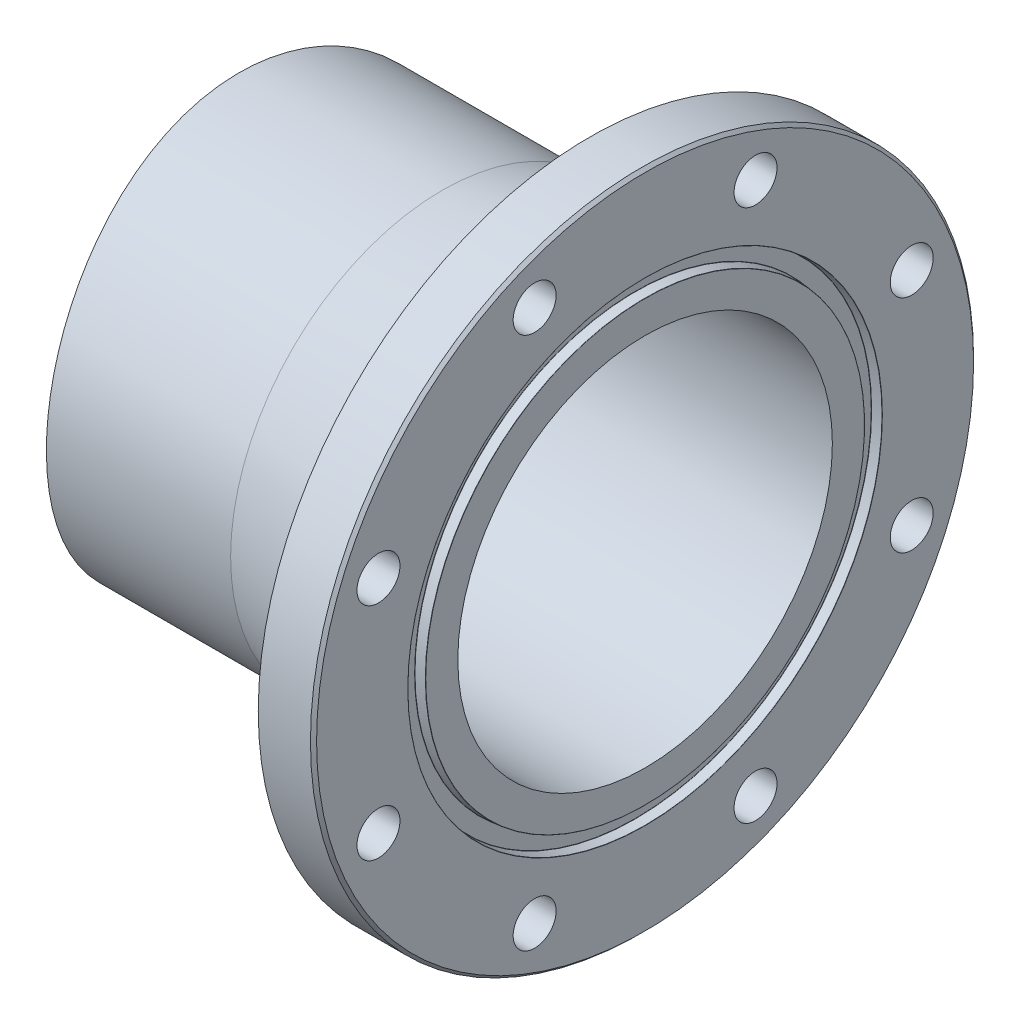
ISO-10303-21;
HEADER;
FILE_DESCRIPTION(('STEP AP214'),'2;1');
FILE_NAME('part.step','',(''),(''),'','','');
FILE_SCHEMA(('AUTOMOTIVE_DESIGN { 1 0 10303 214 1 1 1 1 }'));
ENDSEC;
DATA;
#1=APPLICATION_CONTEXT('core data for automotive mechanical design processes');
#2=APPLICATION_PROTOCOL_DEFINITION('international standard','automotive_design',2000,#1);
#3=PRODUCT_CONTEXT('',#1,'mechanical');
#4=PRODUCT('Part','Part','',(#3));
#5=PRODUCT_RELATED_PRODUCT_CATEGORY('part','',(#4));
#6=PRODUCT_DEFINITION_FORMATION('','',#4);
#7=PRODUCT_DEFINITION_CONTEXT('part definition',#1,'design');
#8=PRODUCT_DEFINITION('design','',#6,#7);
#9=PRODUCT_DEFINITION_SHAPE('','',#8);
#10=(LENGTH_UNIT() NAMED_UNIT(*) SI_UNIT(.MILLI.,.METRE.));
#11=(NAMED_UNIT(*) PLANE_ANGLE_UNIT() SI_UNIT($,.RADIAN.));
#12=(NAMED_UNIT(*) SI_UNIT($,.STERADIAN.) SOLID_ANGLE_UNIT());
#13=UNCERTAINTY_MEASURE_WITH_UNIT(LENGTH_MEASURE(1.E-05),#10,'distance_accuracy_value','');
#14=(GEOMETRIC_REPRESENTATION_CONTEXT(3) GLOBAL_UNCERTAINTY_ASSIGNED_CONTEXT((#13)) GLOBAL_UNIT_ASSIGNED_CONTEXT((#10,
#11,#12)) REPRESENTATION_CONTEXT('',''));
#15=CARTESIAN_POINT('',(0.,0.,0.));
#16=DIRECTION('',(0.,0.,1.));
#17=DIRECTION('',(1.,0.,0.));
#18=AXIS2_PLACEMENT_3D('',#15,#16,#17);
#19=CARTESIAN_POINT('',(0.,0.,0.));
#20=DIRECTION('',(-1.,0.,0.));
#21=DIRECTION('',(0.,0.,1.));
#22=AXIS2_PLACEMENT_3D('',#19,#20,#21);
#23=CYLINDRICAL_SURFACE('',#22,96.8375);
#24=CARTESIAN_POINT('',(19.05,0.,96.8375));
#25=CARTESIAN_POINT('',(19.0500011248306,1.35111206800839,96.837502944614));
#26=CARTESIAN_POINT('',(19.0455060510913,2.70215124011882,96.809221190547));
#27=CARTESIAN_POINT('',(19.0275604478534,5.40179370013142,96.6961578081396));
#28=CARTESIAN_POINT('',(19.014110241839,6.75039707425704,96.6113782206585));
#29=CARTESIAN_POINT('',(18.9783443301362,9.44303387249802,96.3854570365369));
#30=CARTESIAN_POINT('',(18.956026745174,10.7870662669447,96.2443034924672));
#31=CARTESIAN_POINT('',(18.9026831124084,13.4679056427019,95.9059032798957));
#32=CARTESIAN_POINT('',(18.8716568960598,14.80471248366,95.7086555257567));
#33=CARTESIAN_POINT('',(18.8010857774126,17.469762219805,95.258262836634));
#34=CARTESIAN_POINT('',(18.7615340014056,18.7979973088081,95.0050727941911));
#35=CARTESIAN_POINT('',(18.6742009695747,21.442561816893,94.4433450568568));
#36=CARTESIAN_POINT('',(18.626418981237,22.7588901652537,94.1348024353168));
#37=CARTESIAN_POINT('',(18.5229709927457,25.3769990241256,93.4630168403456));
#38=CARTESIAN_POINT('',(18.4673061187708,26.6787815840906,93.0997816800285));
#39=CARTESIAN_POINT('',(18.3484718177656,29.2658146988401,92.3192242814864));
#40=CARTESIAN_POINT('',(18.2853016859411,30.5510636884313,91.9018969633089));
#41=CARTESIAN_POINT('',(18.1519614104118,33.1015322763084,91.0143479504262));
#42=CARTESIAN_POINT('',(18.0817974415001,34.3667684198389,90.5441728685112));
#43=CARTESIAN_POINT('',(17.9349055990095,36.8762746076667,89.5514529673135));
#44=CARTESIAN_POINT('',(17.8581771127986,38.1205426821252,89.0289032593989));
#45=CARTESIAN_POINT('',(17.6987022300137,40.5857337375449,87.9324701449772));
#46=CARTESIAN_POINT('',(17.6159563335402,41.8066586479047,87.3585910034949));
#47=CARTESIAN_POINT('',(17.4450074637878,44.2232787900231,86.160443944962));
#48=CARTESIAN_POINT('',(17.3568039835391,45.418971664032,85.5361713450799));
#49=CARTESIAN_POINT('',(17.1755794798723,47.7826821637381,84.2385539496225));
#50=CARTESIAN_POINT('',(17.0825596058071,48.9507062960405,83.5652208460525));
#51=CARTESIAN_POINT('',(16.8923183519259,51.2574817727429,82.1704864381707));
#52=CARTESIAN_POINT('',(16.7950965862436,52.3962304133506,81.4490807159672));
#53=CARTESIAN_POINT('',(16.5971374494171,54.6423302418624,79.9595688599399));
#54=CARTESIAN_POINT('',(16.496400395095,55.7496842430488,79.1914669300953));
#55=CARTESIAN_POINT('',(16.2920980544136,57.9312434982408,77.6098477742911));
#56=CARTESIAN_POINT('',(16.1885325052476,59.0054456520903,76.7963263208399));
#57=CARTESIAN_POINT('',(15.8730455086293,62.191849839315,74.2767947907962));
#58=CARTESIAN_POINT('',(15.6578467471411,64.2508609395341,72.5030792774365));
#59=CARTESIAN_POINT('',(15.2249008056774,68.2121891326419,68.7893337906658));
#60=CARTESIAN_POINT('',(15.0071536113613,70.1145053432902,66.8493028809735));
#61=CARTESIAN_POINT('',(14.5751738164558,73.7498128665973,62.8158951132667));
#62=CARTESIAN_POINT('',(14.3609414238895,75.4827941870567,60.7225092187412));
#63=CARTESIAN_POINT('',(13.9420508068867,78.7671406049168,56.3969308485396));
#64=CARTESIAN_POINT('',(13.7373925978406,80.3185054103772,54.1647381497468));
#65=CARTESIAN_POINT('',(13.3423533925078,83.2368107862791,49.5640639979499));
#66=CARTESIAN_POINT('',(13.1520583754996,84.6026746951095,47.1948919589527));
#67=CARTESIAN_POINT('',(12.7925180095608,87.129764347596,42.3482540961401));
#68=CARTESIAN_POINT('',(12.6232727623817,88.2909891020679,39.8707877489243));
#69=CARTESIAN_POINT('',(12.3107750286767,90.4001286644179,34.8251964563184));
#70=CARTESIAN_POINT('',(12.1675213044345,91.3480536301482,32.2570758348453));
#71=CARTESIAN_POINT('',(11.9112119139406,93.0234761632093,27.0484435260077));
#72=CARTESIAN_POINT('',(11.7981559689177,93.7509757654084,24.4079325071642));
#73=CARTESIAN_POINT('',(11.6063993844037,94.9747939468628,19.0959753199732));
#74=CARTESIAN_POINT('',(11.5274188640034,95.4729982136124,16.4249736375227));
#75=CARTESIAN_POINT('',(11.4047631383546,96.2433148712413,11.0497587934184));
#76=CARTESIAN_POINT('',(11.3610877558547,96.5154283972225,8.3455457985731));
#77=CARTESIAN_POINT('',(11.3103310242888,96.8314395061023,2.92362883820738));
#78=CARTESIAN_POINT('',(11.3032475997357,96.8753500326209,0.20592564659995));
#79=CARTESIAN_POINT('',(11.3258786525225,96.7346461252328,-5.22339639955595));
#80=CARTESIAN_POINT('',(11.3555929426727,96.5500328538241,-7.93501528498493));
#81=CARTESIAN_POINT('',(11.4504948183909,95.9565173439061,-13.3072632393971));
#82=CARTESIAN_POINT('',(11.5153481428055,95.5497282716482,-15.9681320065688));
#83=CARTESIAN_POINT('',(11.6784323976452,94.5163922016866,-21.2457830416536));
#84=CARTESIAN_POINT('',(11.776663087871,93.8898467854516,-23.8625656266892));
#85=CARTESIAN_POINT('',(12.0036862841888,92.4216764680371,-29.0337662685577));
#86=CARTESIAN_POINT('',(12.1324794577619,91.5800468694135,-31.5881829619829));
#87=CARTESIAN_POINT('',(12.416958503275,89.6879115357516,-36.6168966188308));
#88=CARTESIAN_POINT('',(12.5726445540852,88.6374044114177,-39.0911930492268));
#89=CARTESIAN_POINT('',(12.9072436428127,86.3300594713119,-43.9533272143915));
#90=CARTESIAN_POINT('',(13.0862553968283,85.0723383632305,-46.3407389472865));
#91=CARTESIAN_POINT('',(13.461916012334,82.3628254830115,-51.0012947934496));
#92=CARTESIAN_POINT('',(13.658564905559,80.9110333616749,-53.2744387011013));
#93=CARTESIAN_POINT('',(14.0640039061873,77.8234529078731,-57.6911798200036));
#94=CARTESIAN_POINT('',(14.2727947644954,76.1876531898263,-59.8347690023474));
#95=CARTESIAN_POINT('',(14.6966993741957,72.7434025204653,-63.9777758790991));
#96=CARTESIAN_POINT('',(14.911813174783,70.9349502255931,-65.9771924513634));
#97=CARTESIAN_POINT('',(15.3448353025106,67.1364466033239,-69.8399490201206));
#98=CARTESIAN_POINT('',(15.5627478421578,65.1445811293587,-71.7015050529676));
#99=CARTESIAN_POINT('',(15.9928073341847,61.0106585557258,-75.2503956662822));
#100=CARTESIAN_POINT('',(16.2049542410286,58.8686002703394,-76.9377288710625));
#101=CARTESIAN_POINT('',(16.6175080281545,54.4490753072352,-80.1263027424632));
#102=CARTESIAN_POINT('',(16.8179147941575,52.1716073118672,-81.6275415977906));
#103=CARTESIAN_POINT('',(17.2013353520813,47.4970834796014,-84.43316326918));
#104=CARTESIAN_POINT('',(17.3843491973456,45.100028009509,-85.7375466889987));
#105=CARTESIAN_POINT('',(17.7279371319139,40.2012884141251,-88.1408333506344));
#106=CARTESIAN_POINT('',(17.8884947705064,37.6995293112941,-89.2395861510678));
#107=CARTESIAN_POINT('',(18.1824505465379,32.6107108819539,-91.2222539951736));
#108=CARTESIAN_POINT('',(18.3158486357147,30.0236514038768,-92.1061686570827));
#109=CARTESIAN_POINT('',(18.5516714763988,24.7829171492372,-93.6523995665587));
#110=CARTESIAN_POINT('',(18.6540981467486,22.1292465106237,-94.3147295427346));
#111=CARTESIAN_POINT('',(18.8250539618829,16.774352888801,-95.4127475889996));
#112=CARTESIAN_POINT('',(18.893583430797,14.0731303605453,-95.848437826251));
#113=CARTESIAN_POINT('',(18.9942357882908,8.67192267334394,-96.4863459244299));
#114=CARTESIAN_POINT('',(19.026740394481,5.9722335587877,-96.6910121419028));
#115=CARTESIAN_POINT('',(19.0557333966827,0.565013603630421,-96.8736282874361));
#116=CARTESIAN_POINT('',(19.0522220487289,-2.14251718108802,-96.8515798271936));
#117=CARTESIAN_POINT('',(19.0092830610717,-7.54584999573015,-96.5809437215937));
#118=CARTESIAN_POINT('',(18.9698566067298,-10.2416524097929,-96.3323635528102));
#119=CARTESIAN_POINT('',(18.8562001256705,-15.6022679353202,-95.6105899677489));
#120=CARTESIAN_POINT('',(18.7819701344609,-18.2670810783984,-95.1373967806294));
#121=CARTESIAN_POINT('',(18.6012904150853,-23.5322486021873,-93.9732107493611));
#122=CARTESIAN_POINT('',(18.4950191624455,-26.1328758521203,-93.2834235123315));
#123=CARTESIAN_POINT('',(18.253063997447,-31.2664825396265,-91.6904105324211));
#124=CARTESIAN_POINT('',(18.1173802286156,-33.7994623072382,-90.7871858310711));
#125=CARTESIAN_POINT('',(17.820338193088,-38.7803691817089,-88.7738725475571));
#126=CARTESIAN_POINT('',(17.6589789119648,-41.2282929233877,-87.6637757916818));
#127=CARTESIAN_POINT('',(17.3150238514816,-46.0222646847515,-85.2447139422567));
#128=CARTESIAN_POINT('',(17.1324278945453,-48.368311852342,-83.9357471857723));
#129=CARTESIAN_POINT('',(16.7494564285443,-52.9611563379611,-81.1168049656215));
#130=CARTESIAN_POINT('',(16.5489490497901,-55.2069973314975,-79.6052892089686));
#131=CARTESIAN_POINT('',(16.1370015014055,-59.5636707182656,-76.4001574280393));
#132=CARTESIAN_POINT('',(15.9255612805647,-61.6745024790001,-74.7065405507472));
#133=CARTESIAN_POINT('',(15.4976030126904,-65.746908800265,-71.1488315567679));
#134=CARTESIAN_POINT('',(15.281084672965,-67.708474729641,-69.2847295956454));
#135=CARTESIAN_POINT('',(14.8489985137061,-71.4688423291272,-65.3988998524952));
#136=CARTESIAN_POINT('',(14.633430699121,-73.2676431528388,-63.377171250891));
#137=CARTESIAN_POINT('',(14.2072666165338,-76.7061854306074,-59.1701951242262));
#138=CARTESIAN_POINT('',(13.9967359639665,-78.3442763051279,-56.983591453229));
#139=CARTESIAN_POINT('',(13.5887840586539,-81.4304203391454,-52.4789680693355));
#140=CARTESIAN_POINT('',(13.3913628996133,-82.878472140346,-50.1609474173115));
#141=CARTESIAN_POINT('',(13.0153173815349,-85.5740644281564,-45.4096994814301));
#142=CARTESIAN_POINT('',(12.8366926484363,-86.8216089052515,-42.9764744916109));
#143=CARTESIAN_POINT('',(12.5034219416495,-89.1070411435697,-38.0118932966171));
#144=CARTESIAN_POINT('',(12.3487758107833,-90.1449302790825,-35.4805377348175));
#145=CARTESIAN_POINT('',(12.0685342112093,-91.9996695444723,-30.3476514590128));
#146=CARTESIAN_POINT('',(11.9428285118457,-92.8173604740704,-27.7464306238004));
#147=CARTESIAN_POINT('',(11.7233866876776,-94.2307796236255,-22.483031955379));
#148=CARTESIAN_POINT('',(11.6296505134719,-94.826508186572,-19.820854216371));
#149=CARTESIAN_POINT('',(11.4769198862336,-95.7913708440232,-14.4549363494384));
#150=CARTESIAN_POINT('',(11.4179231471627,-96.1605198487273,-11.7511989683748));
#151=CARTESIAN_POINT('',(11.3364132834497,-96.6693965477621,-6.32168036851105));
#152=CARTESIAN_POINT('',(11.3138998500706,-96.8091261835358,-3.59589933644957));
#153=CARTESIAN_POINT('',(11.3060687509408,-96.8577971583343,1.82689496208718));
#154=CARTESIAN_POINT('',(11.3203330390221,-96.7693323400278,4.52388470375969));
#155=CARTESIAN_POINT('',(11.3847596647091,-96.3677660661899,9.90063761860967));
#156=CARTESIAN_POINT('',(11.4349217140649,-96.0546664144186,12.5804009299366));
#157=CARTESIAN_POINT('',(11.5696870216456,-95.2062318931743,17.903601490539));
#158=CARTESIAN_POINT('',(11.6542900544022,-94.6708984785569,20.5470389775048));
#159=CARTESIAN_POINT('',(11.8554930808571,-93.3820471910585,25.7789283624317));
#160=CARTESIAN_POINT('',(11.9720931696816,-92.6285286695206,28.3673800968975));
#161=CARTESIAN_POINT('',(12.2338159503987,-90.9097655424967,33.4686950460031));
#162=CARTESIAN_POINT('',(12.378910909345,-89.9447266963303,35.9816290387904));
#163=CARTESIAN_POINT('',(12.6935743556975,-87.8095300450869,40.9171995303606));
#164=CARTESIAN_POINT('',(12.8631427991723,-86.63937260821,43.3398361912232));
#165=CARTESIAN_POINT('',(13.2219726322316,-84.1023536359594,48.0782612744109));
#166=CARTESIAN_POINT('',(13.4112345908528,-82.7354864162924,50.3940466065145));
#167=CARTESIAN_POINT('',(13.8041988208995,-79.8143624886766,54.9033999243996));
#168=CARTESIAN_POINT('',(14.0079012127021,-78.2601042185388,57.0969668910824));
#169=CARTESIAN_POINT('',(14.3210991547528,-75.7879503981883,60.2953746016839));
#170=CARTESIAN_POINT('',(14.4273716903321,-74.9354106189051,61.3516753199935));
#171=CARTESIAN_POINT('',(14.641398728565,-73.186792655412,63.4274035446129));
#172=CARTESIAN_POINT('',(14.7491530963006,-72.2907184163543,64.4468343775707));
#173=CARTESIAN_POINT('',(14.9653978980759,-70.456481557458,66.447178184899));
#174=CARTESIAN_POINT('',(15.0738884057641,-69.5183146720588,67.428087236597));
#175=CARTESIAN_POINT('',(15.2908243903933,-67.6016680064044,69.3495278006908));
#176=CARTESIAN_POINT('',(15.3992698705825,-66.6231919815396,70.2900630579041));
#177=CARTESIAN_POINT('',(15.6154001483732,-64.6272050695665,72.1295244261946));
#178=CARTESIAN_POINT('',(15.7230846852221,-63.6096815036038,73.0284368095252));
#179=CARTESIAN_POINT('',(15.9368924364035,-61.5377431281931,74.782685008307));
#180=CARTESIAN_POINT('',(16.0430157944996,-60.4833317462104,75.6380248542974));
#181=CARTESIAN_POINT('',(16.2529765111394,-58.3392496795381,77.3037933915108));
#182=CARTESIAN_POINT('',(16.3568136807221,-57.249576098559,78.1142183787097));
#183=CARTESIAN_POINT('',(16.5614558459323,-55.0370270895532,79.6885837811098));
#184=CARTESIAN_POINT('',(16.6622611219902,-53.9141547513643,80.45252850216));
#185=CARTESIAN_POINT('',(16.8607678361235,-51.6298530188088,81.9373360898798));
#186=CARTESIAN_POINT('',(16.9584456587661,-50.4682249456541,82.6578964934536));
#187=CARTESIAN_POINT('',(17.1493223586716,-48.1153464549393,84.0492871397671));
#188=CARTESIAN_POINT('',(17.2425216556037,-46.9240988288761,84.7201220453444));
#189=CARTESIAN_POINT('',(17.4238019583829,-44.5137837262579,86.0110094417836));
#190=CARTESIAN_POINT('',(17.5118821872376,-43.2947120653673,86.6310542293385));
#191=CARTESIAN_POINT('',(17.6822736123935,-40.8311850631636,87.8190505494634));
#192=CARTESIAN_POINT('',(17.7645853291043,-39.5867320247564,88.3870067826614));
#193=CARTESIAN_POINT('',(17.9227917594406,-37.0756378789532,89.4693584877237));
#194=CARTESIAN_POINT('',(17.9986920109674,-35.8090170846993,89.9838002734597));
#195=CARTESIAN_POINT('',(18.1436122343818,-33.2548139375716,90.9587123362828));
#196=CARTESIAN_POINT('',(18.2126323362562,-31.9672319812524,91.4191836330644));
#197=CARTESIAN_POINT('',(18.343285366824,-29.3736685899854,92.2851972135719));
#198=CARTESIAN_POINT('',(18.4049199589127,-28.0676913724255,92.690751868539));
#199=CARTESIAN_POINT('',(18.5203795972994,-25.4394076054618,93.4462836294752));
#200=CARTESIAN_POINT('',(18.5742043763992,-24.1171004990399,93.796258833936));
#201=CARTESIAN_POINT('',(18.6935871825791,-20.9256317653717,94.5689660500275));
#202=CARTESIAN_POINT('',(18.7552019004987,-19.0496997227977,94.9646417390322));
#203=CARTESIAN_POINT('',(18.8614661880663,-15.27700887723,95.6440744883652));
#204=CARTESIAN_POINT('',(18.9061134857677,-13.3802473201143,95.9278165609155));
#205=CARTESIAN_POINT('',(18.9778044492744,-9.57291839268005,96.3822398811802));
#206=CARTESIAN_POINT('',(19.0048483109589,-7.66235117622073,96.5529223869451));
#207=CARTESIAN_POINT('',(19.0409440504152,-3.83447307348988,96.7805425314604));
#208=CARTESIAN_POINT('',(19.0499984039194,-1.91716315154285,96.8374958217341));
#209=CARTESIAN_POINT('',(19.05,0.,96.8375));
#210=B_SPLINE_CURVE_WITH_KNOTS('',3,(#24,#25,#26,#27,#28,#29,#30,#31,#32,#33,#34,#35,#36,#37,
#38,#39,#40,#41,#42,#43,#44,#45,#46,#47,#48,#49,#50,#51,#52,#53,#54,#55,#56,#57,#58,#59,#60,#61,
#62,#63,#64,#65,#66,#67,#68,#69,#70,#71,#72,#73,#74,#75,#76,#77,#78,#79,#80,#81,#82,#83,#84,#85,
#86,#87,#88,#89,#90,#91,#92,#93,#94,#95,#96,#97,#98,#99,#100,#101,#102,#103,#104,#105,#106,#107,
#108,#109,#110,#111,#112,#113,#114,#115,#116,#117,#118,#119,#120,#121,#122,#123,#124,#125,#126,
#127,#128,#129,#130,#131,#132,#133,#134,#135,#136,#137,#138,#139,#140,#141,#142,#143,#144,#145,
#146,#147,#148,#149,#150,#151,#152,#153,#154,#155,#156,#157,#158,#159,#160,#161,#162,#163,#164,
#165,#166,#167,#168,#169,#170,#171,#172,#173,#174,#175,#176,#177,#178,#179,#180,#181,#182,#183,
#184,#185,#186,#187,#188,#189,#190,#191,#192,#193,#194,#195,#196,#197,#198,#199,#200,#201,#202,
#203,#204,#205,#206,#207,#208,#209),.UNSPECIFIED.,.T.,.F.,(4,2,2,2,2,2,2,2,2,2,2,2,2,2,2,2,2,2,
2,2,2,2,2,2,2,2,2,2,2,2,2,2,2,2,2,2,2,2,2,2,2,2,2,2,2,2,2,2,2,2,2,2,2,2,2,2,2,2,2,2,2,2,2,2,2,2,
2,2,2,2,2,2,2,2,2,2,2,2,2,2,2,2,2,2,2,2,2,2,2,2,2,2,4),(0.,4.05290671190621,8.10566702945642,
12.1592867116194,16.2129848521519,20.2699635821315,24.3273035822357,28.3840645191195,
32.4412067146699,36.4947981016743,40.548768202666,44.6024017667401,48.6564124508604,
52.7094601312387,56.7628808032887,60.8159370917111,64.8693712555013,73.0373635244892,
81.2054017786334,89.3739217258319,97.5424548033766,105.756538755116,113.970662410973,
122.18439480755,130.398051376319,138.542897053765,146.687701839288,154.832044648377,
162.976346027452,171.044500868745,179.112597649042,187.180870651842,195.249197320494,
203.352851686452,211.45652063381,219.560691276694,227.664924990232,235.860333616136,
244.055806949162,252.251360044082,260.446888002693,268.648388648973,276.849903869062,
285.050910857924,293.251839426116,301.365014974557,309.478132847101,317.590982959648,
325.70382479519,333.772286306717,341.840708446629,349.909449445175,357.978257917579,
366.112334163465,374.246448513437,382.381032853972,390.515659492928,398.72660311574,
406.937605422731,415.148444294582,423.359229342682,431.538203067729,439.717164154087,
447.895586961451,456.073940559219,464.15974305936,472.245480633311,480.331165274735,
488.416873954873,496.494751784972,504.572615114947,512.650711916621,520.728876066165,
524.81262146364,528.895997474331,532.979788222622,537.063199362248,541.147947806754,
545.232317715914,549.317023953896,553.401351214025,557.511466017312,561.62119491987,
565.731545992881,569.84152576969,573.947918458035,578.054233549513,582.159622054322,
586.265150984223,592.01611683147,597.767852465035,603.519524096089,609.270404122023),.UNSPECIFIED.);
#211=CARTESIAN_POINT('',(19.05,0.,96.8375));
#212=VERTEX_POINT('',#211);
#213=EDGE_CURVE('E69',#212,#212,#210,.T.);
#214=ORIENTED_EDGE('',*,*,#213,.T.);
#215=EDGE_LOOP('',(#214));
#216=FACE_BOUND('',#215,.T.);
#217=CARTESIAN_POINT('',(219.075,0.,0.));
#218=DIRECTION('',(-1.,0.,0.));
#219=DIRECTION('',(0.,0.,1.));
#220=AXIS2_PLACEMENT_3D('',#217,#218,#219);
#221=CIRCLE('',#220,96.8375);
#222=CARTESIAN_POINT('',(219.075,0.,96.8375));
#223=VERTEX_POINT('',#222);
#224=EDGE_CURVE('E51',#223,#223,#221,.T.);
#225=ORIENTED_EDGE('',*,*,#224,.F.);
#226=EDGE_LOOP('',(#225));
#227=FACE_BOUND('',#226,.T.);
#228=ADVANCED_FACE('F31',(#216,#227),#23,.F.);
#229=CARTESIAN_POINT('',(219.075,0.,-96.8375));
#230=DIRECTION('',(-1.,0.,0.));
#231=DIRECTION('',(0.,0.,1.));
#232=AXIS2_PLACEMENT_3D('',#229,#230,#231);
#233=PLANE('',#232);
#234=CARTESIAN_POINT('',(219.075,0.,0.));
#235=DIRECTION('',(-1.,0.,0.));
#236=DIRECTION('',(0.,0.,1.));
#237=AXIS2_PLACEMENT_3D('',#234,#235,#236);
#238=CIRCLE('',#237,113.419461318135);
#239=CARTESIAN_POINT('',(219.075,0.,113.419461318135));
#240=VERTEX_POINT('',#239);
#241=EDGE_CURVE('E147',#240,#240,#238,.T.);
#242=ORIENTED_EDGE('',*,*,#241,.F.);
#243=EDGE_LOOP('',(#242));
#244=FACE_BOUND('',#243,.T.);
#245=ORIENTED_EDGE('',*,*,#224,.T.);
#246=EDGE_LOOP('',(#245));
#247=FACE_BOUND('',#246,.T.);
#248=ADVANCED_FACE('F96',(#244,#247),#233,.F.);
#249=CARTESIAN_POINT('',(218.948,0.,0.));
#250=DIRECTION('',(-1.,0.,0.));
#251=DIRECTION('',(0.,0.,1.));
#252=AXIS2_PLACEMENT_3D('',#249,#250,#251);
#253=TOROIDAL_SURFACE('',#252,113.419461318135,0.126999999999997);
#254=CARTESIAN_POINT('',(218.959068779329,0.,0.));
#255=DIRECTION('',(-1.,0.,0.));
#256=DIRECTION('',(0.,0.,1.));
#257=AXIS2_PLACEMENT_3D('',#254,#255,#256);
#258=CIRCLE('',#257,113.545978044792);
#259=CARTESIAN_POINT('',(218.959068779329,0.,113.545978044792));
#260=VERTEX_POINT('',#259);
#261=EDGE_CURVE('E145',#260,#260,#258,.T.);
#262=ORIENTED_EDGE('',*,*,#261,.F.);
#263=EDGE_LOOP('',(#262));
#264=FACE_BOUND('',#263,.T.);
#265=ORIENTED_EDGE('',*,*,#241,.T.);
#266=EDGE_LOOP('',(#265));
#267=FACE_BOUND('',#266,.T.);
#268=ADVANCED_FACE('F156',(#264,#267),#253,.T.);
#269=CARTESIAN_POINT('',(218.959068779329,0.,0.));
#270=DIRECTION('',(-1.,0.,0.));
#271=DIRECTION('',(0.,0.,1.));
#272=AXIS2_PLACEMENT_3D('',#269,#270,#271);
#273=CONICAL_SURFACE('',#272,113.545978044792,0.0872664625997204);
#274=CARTESIAN_POINT('',(214.085531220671,0.,0.));
#275=DIRECTION('',(-1.,0.,0.));
#276=DIRECTION('',(0.,0.,1.));
#277=AXIS2_PLACEMENT_3D('',#274,#275,#276);
#278=CIRCLE('',#277,113.972357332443);
#279=CARTESIAN_POINT('',(214.085531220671,0.,113.972357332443));
#280=VERTEX_POINT('',#279);
#281=EDGE_CURVE('E142',#280,#280,#278,.T.);
#282=ORIENTED_EDGE('',*,*,#281,.F.);
#283=EDGE_LOOP('',(#282));
#284=FACE_BOUND('',#283,.T.);
#285=ORIENTED_EDGE('',*,*,#261,.T.);
#286=EDGE_LOOP('',(#285));
#287=FACE_BOUND('',#286,.T.);
#288=ADVANCED_FACE('F161',(#284,#287),#273,.T.);
#289=CARTESIAN_POINT('',(214.0966,0.,0.));
#290=DIRECTION('',(-1.,0.,0.));
#291=DIRECTION('',(0.,0.,1.));
#292=AXIS2_PLACEMENT_3D('',#289,#290,#291);
#293=TOROIDAL_SURFACE('',#292,114.0988740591,0.126999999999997);
#294=CARTESIAN_POINT('',(213.9696,0.,0.));
#295=DIRECTION('',(-1.,0.,0.));
#296=DIRECTION('',(0.,0.,1.));
#297=AXIS2_PLACEMENT_3D('',#294,#295,#296);
#298=CIRCLE('',#297,114.0988740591);
#299=CARTESIAN_POINT('',(213.9696,0.,114.0988740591));
#300=VERTEX_POINT('',#299);
#301=EDGE_CURVE('E139',#300,#300,#298,.T.);
#302=ORIENTED_EDGE('',*,*,#301,.F.);
#303=EDGE_LOOP('',(#302));
#304=FACE_BOUND('',#303,.T.);
#305=ORIENTED_EDGE('',*,*,#281,.T.);
#306=EDGE_LOOP('',(#305));
#307=FACE_BOUND('',#306,.T.);
#308=ADVANCED_FACE('F166',(#304,#307),#293,.F.);
#309=CARTESIAN_POINT('',(213.9696,0.,-114.0988740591));
#310=DIRECTION('',(-1.,0.,0.));
#311=DIRECTION('',(0.,0.,1.));
#312=AXIS2_PLACEMENT_3D('',#309,#310,#311);
#313=PLANE('',#312);
#314=CARTESIAN_POINT('',(213.9696,0.,0.));
#315=DIRECTION('',(-1.,0.,0.));
#316=DIRECTION('',(0.,0.,1.));
#317=AXIS2_PLACEMENT_3D('',#314,#315,#316);
#318=CIRCLE('',#317,122.0449259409);
#319=CARTESIAN_POINT('',(213.9696,0.,122.0449259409));
#320=VERTEX_POINT('',#319);
#321=EDGE_CURVE('E136',#320,#320,#318,.T.);
#322=ORIENTED_EDGE('',*,*,#321,.F.);
#323=EDGE_LOOP('',(#322));
#324=FACE_BOUND('',#323,.T.);
#325=ORIENTED_EDGE('',*,*,#301,.T.);
#326=EDGE_LOOP('',(#325));
#327=FACE_BOUND('',#326,.T.);
#328=ADVANCED_FACE('F173',(#324,#327),#313,.F.);
#329=CARTESIAN_POINT('',(214.0966,0.,0.));
#330=DIRECTION('',(-1.,0.,0.));
#331=DIRECTION('',(0.,0.,1.));
#332=AXIS2_PLACEMENT_3D('',#329,#330,#331);
#333=TOROIDAL_SURFACE('',#332,122.0449259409,0.126999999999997);
#334=CARTESIAN_POINT('',(214.085531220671,0.,0.));
#335=DIRECTION('',(-1.,0.,0.));
#336=DIRECTION('',(0.,0.,1.));
#337=AXIS2_PLACEMENT_3D('',#334,#335,#336);
#338=CIRCLE('',#337,122.171442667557);
#339=CARTESIAN_POINT('',(214.085531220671,0.,122.171442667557));
#340=VERTEX_POINT('',#339);
#341=EDGE_CURVE('E133',#340,#340,#338,.T.);
#342=ORIENTED_EDGE('',*,*,#341,.F.);
#343=EDGE_LOOP('',(#342));
#344=FACE_BOUND('',#343,.T.);
#345=ORIENTED_EDGE('',*,*,#321,.T.);
#346=EDGE_LOOP('',(#345));
#347=FACE_BOUND('',#346,.T.);
#348=ADVANCED_FACE('F177',(#344,#347),#333,.F.);
#349=CARTESIAN_POINT('',(214.085531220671,0.,0.));
#350=DIRECTION('',(1.,0.,0.));
#351=DIRECTION('',(0.,0.,-1.));
#352=AXIS2_PLACEMENT_3D('',#349,#350,#351);
#353=CONICAL_SURFACE('',#352,122.171442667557,0.0872664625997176);
#354=CARTESIAN_POINT('',(218.959068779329,0.,0.));
#355=DIRECTION('',(-1.,0.,0.));
#356=DIRECTION('',(0.,0.,1.));
#357=AXIS2_PLACEMENT_3D('',#354,#355,#356);
#358=CIRCLE('',#357,122.597821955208);
#359=CARTESIAN_POINT('',(218.959068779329,0.,122.597821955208));
#360=VERTEX_POINT('',#359);
#361=EDGE_CURVE('E128',#360,#360,#358,.T.);
#362=ORIENTED_EDGE('',*,*,#361,.F.);
#363=EDGE_LOOP('',(#362));
#364=FACE_BOUND('',#363,.T.);
#365=ORIENTED_EDGE('',*,*,#341,.T.);
#366=EDGE_LOOP('',(#365));
#367=FACE_BOUND('',#366,.T.);
#368=ADVANCED_FACE('F181',(#364,#367),#353,.F.);
#369=CARTESIAN_POINT('',(218.948,0.,0.));
#370=DIRECTION('',(-1.,0.,0.));
#371=DIRECTION('',(0.,0.,1.));
#372=AXIS2_PLACEMENT_3D('',#369,#370,#371);
#373=TOROIDAL_SURFACE('',#372,122.724338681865,0.126999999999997);
#374=CARTESIAN_POINT('',(219.075,0.,0.));
#375=DIRECTION('',(-1.,0.,0.));
#376=DIRECTION('',(0.,0.,1.));
#377=AXIS2_PLACEMENT_3D('',#374,#375,#376);
#378=CIRCLE('',#377,122.724338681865);
#379=CARTESIAN_POINT('',(219.075,0.,122.724338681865));
#380=VERTEX_POINT('',#379);
#381=EDGE_CURVE('E124',#380,#380,#378,.T.);
#382=ORIENTED_EDGE('',*,*,#381,.F.);
#383=EDGE_LOOP('',(#382));
#384=FACE_BOUND('',#383,.T.);
#385=ORIENTED_EDGE('',*,*,#361,.T.);
#386=EDGE_LOOP('',(#385));
#387=FACE_BOUND('',#386,.T.);
#388=ADVANCED_FACE('F185',(#384,#387),#373,.T.);
#389=CARTESIAN_POINT('',(219.075,0.,-122.724338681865));
#390=DIRECTION('',(-1.,0.,0.));
#391=DIRECTION('',(0.,0.,1.));
#392=AXIS2_PLACEMENT_3D('',#389,#390,#391);
#393=PLANE('',#392);
#394=CARTESIAN_POINT('',(219.075,0.,0.));
#395=DIRECTION('',(-1.,0.,0.));
#396=DIRECTION('',(0.,0.,1.));
#397=AXIS2_PLACEMENT_3D('',#394,#395,#396);
#398=CIRCLE('',#397,169.8625);
#399=CARTESIAN_POINT('',(219.075,0.,169.8625));
#400=VERTEX_POINT('',#399);
#401=EDGE_CURVE('E10',#400,#400,#398,.F.);
#402=ORIENTED_EDGE('',*,*,#401,.T.);
#403=EDGE_LOOP('',(#402));
#404=FACE_BOUND('',#403,.T.);
#405=CARTESIAN_POINT('',(219.075,137.865923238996,57.1059351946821));
#406=DIRECTION('',(1.,0.,0.));
#407=DIRECTION('',(0.,0.,-1.));
#408=AXIS2_PLACEMENT_3D('',#405,#406,#407);
#409=CIRCLE('',#408,11.1125);
#410=CARTESIAN_POINT('',(219.075,137.865923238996,45.9934351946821));
#411=VERTEX_POINT('',#410);
#412=EDGE_CURVE('E252',#411,#411,#409,.T.);
#413=ORIENTED_EDGE('',*,*,#412,.F.);
#414=EDGE_LOOP('',(#413));
#415=FACE_BOUND('',#414,.T.);
#416=CARTESIAN_POINT('',(219.075,137.865923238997,-57.1059351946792));
#417=DIRECTION('',(1.,0.,0.));
#418=DIRECTION('',(0.,0.,-1.));
#419=AXIS2_PLACEMENT_3D('',#416,#417,#418);
#420=CIRCLE('',#419,11.1125);
#421=CARTESIAN_POINT('',(219.075,137.865923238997,-68.2184351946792));
#422=VERTEX_POINT('',#421);
#423=EDGE_CURVE('E56',#422,#422,#420,.T.);
#424=ORIENTED_EDGE('',*,*,#423,.F.);
#425=EDGE_LOOP('',(#424));
#426=FACE_BOUND('',#425,.T.);
#427=CARTESIAN_POINT('',(219.075,57.1059351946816,-137.865923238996));
#428=DIRECTION('',(1.,0.,0.));
#429=DIRECTION('',(0.,0.,-1.));
#430=AXIS2_PLACEMENT_3D('',#427,#428,#429);
#431=CIRCLE('',#430,11.1125);
#432=CARTESIAN_POINT('',(219.075,57.1059351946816,-148.978423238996));
#433=VERTEX_POINT('',#432);
#434=EDGE_CURVE('E55',#433,#433,#431,.T.);
#435=ORIENTED_EDGE('',*,*,#434,.F.);
#436=EDGE_LOOP('',(#435));
#437=FACE_BOUND('',#436,.T.);
#438=CARTESIAN_POINT('',(219.075,-57.1059351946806,-137.865923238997));
#439=DIRECTION('',(1.,0.,0.));
#440=DIRECTION('',(0.,0.,-1.));
#441=AXIS2_PLACEMENT_3D('',#438,#439,#440);
#442=CIRCLE('',#441,11.1125);
#443=CARTESIAN_POINT('',(219.075,-57.1059351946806,-148.978423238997));
#444=VERTEX_POINT('',#443);
#445=EDGE_CURVE('E61',#444,#444,#442,.T.);
#446=ORIENTED_EDGE('',*,*,#445,.F.);
#447=EDGE_LOOP('',(#446));
#448=FACE_BOUND('',#447,.T.);
#449=CARTESIAN_POINT('',(219.075,-137.865923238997,-57.1059351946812));
#450=DIRECTION('',(1.,0.,0.));
#451=DIRECTION('',(0.,0.,-1.));
#452=AXIS2_PLACEMENT_3D('',#449,#450,#451);
#453=CIRCLE('',#452,11.1125);
#454=CARTESIAN_POINT('',(219.075,-137.865923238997,-68.2184351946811));
#455=VERTEX_POINT('',#454);
#456=EDGE_CURVE('E60',#455,#455,#453,.T.);
#457=ORIENTED_EDGE('',*,*,#456,.F.);
#458=EDGE_LOOP('',(#457));
#459=FACE_BOUND('',#458,.T.);
#460=CARTESIAN_POINT('',(219.075,-137.865923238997,57.1059351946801));
#461=DIRECTION('',(1.,0.,0.));
#462=DIRECTION('',(0.,0.,-1.));
#463=AXIS2_PLACEMENT_3D('',#460,#461,#462);
#464=CIRCLE('',#463,11.1125);
#465=CARTESIAN_POINT('',(219.075,-137.865923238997,45.9934351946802));
#466=VERTEX_POINT('',#465);
#467=EDGE_CURVE('E238',#466,#466,#464,.T.);
#468=ORIENTED_EDGE('',*,*,#467,.F.);
#469=EDGE_LOOP('',(#468));
#470=FACE_BOUND('',#469,.T.);
#471=CARTESIAN_POINT('',(219.075,-57.1059351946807,137.865923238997));
#472=DIRECTION('',(1.,0.,0.));
#473=DIRECTION('',(0.,0.,-1.));
#474=AXIS2_PLACEMENT_3D('',#471,#472,#473);
#475=CIRCLE('',#474,11.1125);
#476=CARTESIAN_POINT('',(219.075,-57.1059351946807,126.753423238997));
#477=VERTEX_POINT('',#476);
#478=EDGE_CURVE('E232',#477,#477,#475,.T.);
#479=ORIENTED_EDGE('',*,*,#478,.F.);
#480=EDGE_LOOP('',(#479));
#481=FACE_BOUND('',#480,.T.);
#482=CARTESIAN_POINT('',(219.075,57.1059351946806,137.865923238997));
#483=DIRECTION('',(1.,0.,0.));
#484=DIRECTION('',(0.,0.,-1.));
#485=AXIS2_PLACEMENT_3D('',#482,#483,#484);
#486=CIRCLE('',#485,11.1125);
#487=CARTESIAN_POINT('',(219.075,57.1059351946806,126.753423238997));
#488=VERTEX_POINT('',#487);
#489=EDGE_CURVE('E228',#488,#488,#486,.T.);
#490=ORIENTED_EDGE('',*,*,#489,.F.);
#491=EDGE_LOOP('',(#490));
#492=FACE_BOUND('',#491,.T.);
#493=ORIENTED_EDGE('',*,*,#381,.T.);
#494=EDGE_LOOP('',(#493));
#495=FACE_BOUND('',#494,.T.);
#496=ADVANCED_FACE('F189',(#404,#415,#426,#437,#448,#459,#470,#481,#492,#495),#393,.F.);
#497=CARTESIAN_POINT('',(0.,0.,0.));
#498=DIRECTION('',(-1.,0.,0.));
#499=DIRECTION('',(0.,0.,1.));
#500=AXIS2_PLACEMENT_3D('',#497,#498,#499);
#501=CYLINDRICAL_SURFACE('',#500,171.45);
#502=CARTESIAN_POINT('',(217.4875,0.,0.));
#503=DIRECTION('',(-1.,0.,0.));
#504=DIRECTION('',(0.,0.,1.));
#505=AXIS2_PLACEMENT_3D('',#502,#503,#504);
#506=CIRCLE('',#505,171.45);
#507=CARTESIAN_POINT('',(217.4875,0.,171.45));
#508=VERTEX_POINT('',#507);
#509=EDGE_CURVE('E38',#508,#508,#506,.T.);
#510=ORIENTED_EDGE('',*,*,#509,.T.);
#511=EDGE_LOOP('',(#510));
#512=FACE_BOUND('',#511,.T.);
#513=CARTESIAN_POINT('',(190.5,0.,0.));
#514=DIRECTION('',(-1.,0.,0.));
#515=DIRECTION('',(0.,0.,1.));
#516=AXIS2_PLACEMENT_3D('',#513,#514,#515);
#517=CIRCLE('',#516,171.45);
#518=CARTESIAN_POINT('',(190.5,0.,171.45));
#519=VERTEX_POINT('',#518);
#520=EDGE_CURVE('E122',#519,#519,#517,.T.);
#521=ORIENTED_EDGE('',*,*,#520,.F.);
#522=EDGE_LOOP('',(#521));
#523=FACE_BOUND('',#522,.T.);
#524=ADVANCED_FACE('F193',(#512,#523),#501,.T.);
#525=CARTESIAN_POINT('',(190.5,0.,-171.45));
#526=DIRECTION('',(1.,0.,0.));
#527=DIRECTION('',(0.,0.,-1.));
#528=AXIS2_PLACEMENT_3D('',#525,#526,#527);
#529=PLANE('',#528);
#530=CARTESIAN_POINT('',(190.5,0.,0.));
#531=DIRECTION('',(1.,0.,0.));
#532=DIRECTION('',(0.,0.,-1.));
#533=AXIS2_PLACEMENT_3D('',#530,#531,#532);
#534=CIRCLE('',#533,131.730047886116);
#535=CARTESIAN_POINT('',(190.5,0.,-131.730047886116));
#536=VERTEX_POINT('',#535);
#537=EDGE_CURVE('E42',#536,#536,#534,.T.);
#538=ORIENTED_EDGE('',*,*,#537,.T.);
#539=EDGE_LOOP('',(#538));
#540=FACE_BOUND('',#539,.T.);
#541=CARTESIAN_POINT('',(190.5,137.865923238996,57.1059351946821));
#542=DIRECTION('',(1.,0.,0.));
#543=DIRECTION('',(0.,0.,-1.));
#544=AXIS2_PLACEMENT_3D('',#541,#542,#543);
#545=CIRCLE('',#544,11.1125);
#546=CARTESIAN_POINT('',(190.5,137.865923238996,45.9934351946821));
#547=VERTEX_POINT('',#546);
#548=EDGE_CURVE('E204',#547,#547,#545,.T.);
#549=ORIENTED_EDGE('',*,*,#548,.T.);
#550=EDGE_LOOP('',(#549));
#551=FACE_BOUND('',#550,.T.);
#552=CARTESIAN_POINT('',(190.5,137.865923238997,-57.1059351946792));
#553=DIRECTION('',(1.,0.,0.));
#554=DIRECTION('',(0.,0.,-1.));
#555=AXIS2_PLACEMENT_3D('',#552,#553,#554);
#556=CIRCLE('',#555,11.1125);
#557=CARTESIAN_POINT('',(190.5,137.865923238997,-68.2184351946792));
#558=VERTEX_POINT('',#557);
#559=EDGE_CURVE('E52',#558,#558,#556,.T.);
#560=ORIENTED_EDGE('',*,*,#559,.T.);
#561=EDGE_LOOP('',(#560));
#562=FACE_BOUND('',#561,.T.);
#563=CARTESIAN_POINT('',(190.5,57.1059351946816,-137.865923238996));
#564=DIRECTION('',(1.,0.,0.));
#565=DIRECTION('',(0.,0.,-1.));
#566=AXIS2_PLACEMENT_3D('',#563,#564,#565);
#567=CIRCLE('',#566,11.1125);
#568=CARTESIAN_POINT('',(190.5,57.1059351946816,-148.978423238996));
#569=VERTEX_POINT('',#568);
#570=EDGE_CURVE('E210',#569,#569,#567,.T.);
#571=ORIENTED_EDGE('',*,*,#570,.T.);
#572=EDGE_LOOP('',(#571));
#573=FACE_BOUND('',#572,.T.);
#574=CARTESIAN_POINT('',(190.5,-57.1059351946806,-137.865923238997));
#575=DIRECTION('',(1.,0.,0.));
#576=DIRECTION('',(0.,0.,-1.));
#577=AXIS2_PLACEMENT_3D('',#574,#575,#576);
#578=CIRCLE('',#577,11.1125);
#579=CARTESIAN_POINT('',(190.5,-57.1059351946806,-148.978423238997));
#580=VERTEX_POINT('',#579);
#581=EDGE_CURVE('E57',#580,#580,#578,.T.);
#582=ORIENTED_EDGE('',*,*,#581,.T.);
#583=EDGE_LOOP('',(#582));
#584=FACE_BOUND('',#583,.T.);
#585=CARTESIAN_POINT('',(190.5,-137.865923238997,-57.1059351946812));
#586=DIRECTION('',(1.,0.,0.));
#587=DIRECTION('',(0.,0.,-1.));
#588=AXIS2_PLACEMENT_3D('',#585,#586,#587);
#589=CIRCLE('',#588,11.1125);
#590=CARTESIAN_POINT('',(190.5,-137.865923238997,-68.2184351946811));
#591=VERTEX_POINT('',#590);
#592=EDGE_CURVE('E216',#591,#591,#589,.T.);
#593=ORIENTED_EDGE('',*,*,#592,.T.);
#594=EDGE_LOOP('',(#593));
#595=FACE_BOUND('',#594,.T.);
#596=CARTESIAN_POINT('',(190.5,-137.865923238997,57.1059351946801));
#597=DIRECTION('',(1.,0.,0.));
#598=DIRECTION('',(0.,0.,-1.));
#599=AXIS2_PLACEMENT_3D('',#596,#597,#598);
#600=CIRCLE('',#599,11.1125);
#601=CARTESIAN_POINT('',(190.5,-137.865923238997,45.9934351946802));
#602=VERTEX_POINT('',#601);
#603=EDGE_CURVE('E220',#602,#602,#600,.T.);
#604=ORIENTED_EDGE('',*,*,#603,.T.);
#605=EDGE_LOOP('',(#604));
#606=FACE_BOUND('',#605,.T.);
#607=CARTESIAN_POINT('',(190.5,-57.1059351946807,137.865923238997));
#608=DIRECTION('',(1.,0.,0.));
#609=DIRECTION('',(0.,0.,-1.));
#610=AXIS2_PLACEMENT_3D('',#607,#608,#609);
#611=CIRCLE('',#610,11.1125);
#612=CARTESIAN_POINT('',(190.5,-57.1059351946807,126.753423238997));
#613=VERTEX_POINT('',#612);
#614=EDGE_CURVE('E224',#613,#613,#611,.T.);
#615=ORIENTED_EDGE('',*,*,#614,.T.);
#616=EDGE_LOOP('',(#615));
#617=FACE_BOUND('',#616,.T.);
#618=CARTESIAN_POINT('',(190.5,57.1059351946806,137.865923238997));
#619=DIRECTION('',(1.,0.,0.));
#620=DIRECTION('',(0.,0.,-1.));
#621=AXIS2_PLACEMENT_3D('',#618,#619,#620);
#622=CIRCLE('',#621,11.1125);
#623=CARTESIAN_POINT('',(190.5,57.1059351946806,126.753423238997));
#624=VERTEX_POINT('',#623);
#625=EDGE_CURVE('E70',#624,#624,#622,.T.);
#626=ORIENTED_EDGE('',*,*,#625,.T.);
#627=EDGE_LOOP('',(#626));
#628=FACE_BOUND('',#627,.T.);
#629=ORIENTED_EDGE('',*,*,#520,.T.);
#630=EDGE_LOOP('',(#629));
#631=FACE_BOUND('',#630,.T.);
#632=ADVANCED_FACE('F118',(#540,#551,#562,#573,#584,#595,#606,#617,#628,#631),#529,.F.);
#633=CARTESIAN_POINT('',(190.5,0.,0.));
#634=DIRECTION('',(1.,0.,0.));
#635=DIRECTION('',(0.,0.,-1.));
#636=AXIS2_PLACEMENT_3D('',#633,#634,#635);
#637=CONICAL_SURFACE('',#636,123.825,0.185347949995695);
#638=CARTESIAN_POINT('',(182.730348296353,0.,0.));
#639=DIRECTION('',(1.,0.,0.));
#640=DIRECTION('',(0.,0.,-1.));
#641=AXIS2_PLACEMENT_3D('',#638,#639,#640);
#642=CIRCLE('',#641,122.368190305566);
#643=CARTESIAN_POINT('',(182.730348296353,0.,-122.368190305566));
#644=VERTEX_POINT('',#643);
#645=EDGE_CURVE('E46',#644,#644,#642,.F.);
#646=ORIENTED_EDGE('',*,*,#645,.T.);
#647=EDGE_LOOP('',(#646));
#648=FACE_BOUND('',#647,.T.);
#649=CARTESIAN_POINT('',(114.3,0.,0.));
#650=DIRECTION('',(-1.,0.,0.));
#651=DIRECTION('',(0.,0.,1.));
#652=AXIS2_PLACEMENT_3D('',#649,#650,#651);
#653=CIRCLE('',#652,109.5375);
#654=CARTESIAN_POINT('',(114.3,0.,109.5375));
#655=VERTEX_POINT('',#654);
#656=EDGE_CURVE('E90',#655,#655,#653,.T.);
#657=ORIENTED_EDGE('',*,*,#656,.F.);
#658=EDGE_LOOP('',(#657));
#659=FACE_BOUND('',#658,.T.);
#660=ADVANCED_FACE('F115',(#648,#659),#637,.T.);
#661=CARTESIAN_POINT('',(0.,0.,0.));
#662=DIRECTION('',(-1.,0.,0.));
#663=DIRECTION('',(0.,0.,1.));
#664=AXIS2_PLACEMENT_3D('',#661,#662,#663);
#665=CYLINDRICAL_SURFACE('',#664,109.5375);
#666=CARTESIAN_POINT('',(19.05,0.,109.5375));
#667=CARTESIAN_POINT('',(19.0500016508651,-1.52544138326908,109.537503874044));
#668=CARTESIAN_POINT('',(19.044271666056,-3.05079076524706,109.505632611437));
#669=CARTESIAN_POINT('',(19.0213964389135,-6.09872912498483,109.378222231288));
#670=CARTESIAN_POINT('',(19.0042516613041,-7.62131821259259,109.282685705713));
#671=CARTESIAN_POINT('',(18.9586614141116,-10.6612955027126,109.028105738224));
#672=CARTESIAN_POINT('',(18.9302137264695,-12.1786826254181,108.869049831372));
#673=CARTESIAN_POINT('',(18.8622173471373,-15.2052811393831,108.487740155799));
#674=CARTESIAN_POINT('',(18.8226684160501,-16.7144923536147,108.265485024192));
#675=CARTESIAN_POINT('',(18.7327138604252,-19.723115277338,107.758023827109));
#676=CARTESIAN_POINT('',(18.6823002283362,-21.2225189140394,107.472771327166));
#677=CARTESIAN_POINT('',(18.570982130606,-24.2078604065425,106.839935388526));
#678=CARTESIAN_POINT('',(18.5100767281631,-25.6937970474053,106.49234638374));
#679=CARTESIAN_POINT('',(18.3782136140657,-28.6492300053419,105.735575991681));
#680=CARTESIAN_POINT('',(18.3072572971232,-30.1187285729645,105.32640314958));
#681=CARTESIAN_POINT('',(18.1557741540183,-33.0390456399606,104.44716806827));
#682=CARTESIAN_POINT('',(18.0752464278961,-34.4898623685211,103.977100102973));
#683=CARTESIAN_POINT('',(17.9052683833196,-37.3687520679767,102.977472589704));
#684=CARTESIAN_POINT('',(17.8158267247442,-38.79684557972,102.447970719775));
#685=CARTESIAN_POINT('',(17.6285674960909,-41.6293745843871,101.330042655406));
#686=CARTESIAN_POINT('',(17.5307491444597,-43.0338078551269,100.74161096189));
#687=CARTESIAN_POINT('',(17.3274286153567,-45.8163465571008,99.5069987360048));
#688=CARTESIAN_POINT('',(17.2219270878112,-47.1944542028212,98.8608230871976));
#689=CARTESIAN_POINT('',(17.0039503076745,-49.9222371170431,97.5117918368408));
#690=CARTESIAN_POINT('',(16.8914744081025,-51.27190973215,96.8089309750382));
#691=CARTESIAN_POINT('',(16.6603554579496,-53.940124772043,95.3479929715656));
#692=CARTESIAN_POINT('',(16.5417136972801,-55.2586736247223,94.5899273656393));
#693=CARTESIAN_POINT('',(16.2990456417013,-57.8628221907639,93.019728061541));
#694=CARTESIAN_POINT('',(16.1750188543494,-59.1484188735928,92.2075894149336));
#695=CARTESIAN_POINT('',(15.9224486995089,-61.6842949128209,90.5307779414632));
#696=CARTESIAN_POINT('',(15.793905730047,-62.9345773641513,89.6661097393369));
#697=CARTESIAN_POINT('',(15.5331733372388,-65.3978734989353,87.8856789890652));
#698=CARTESIAN_POINT('',(15.4009835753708,-66.6108837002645,86.9699116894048));
#699=CARTESIAN_POINT('',(14.9976761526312,-70.2143023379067,84.1298211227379));
#700=CARTESIAN_POINT('',(14.7222845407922,-72.5446107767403,82.128892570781));
#701=CARTESIAN_POINT('',(14.1680106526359,-77.0285336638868,77.9389995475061));
#702=CARTESIAN_POINT('',(13.8891283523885,-79.1821469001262,75.7500337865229));
#703=CARTESIAN_POINT('',(13.3356086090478,-83.2985290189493,71.1985476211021));
#704=CARTESIAN_POINT('',(13.0609714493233,-85.2612852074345,68.8360156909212));
#705=CARTESIAN_POINT('',(12.5236935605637,-88.982105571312,63.9536540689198));
#706=CARTESIAN_POINT('',(12.2610528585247,-90.7401692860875,61.4338240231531));
#707=CARTESIAN_POINT('',(11.7533753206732,-94.0512135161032,56.235207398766));
#708=CARTESIAN_POINT('',(11.5084798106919,-95.6026159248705,53.5554014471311));
#709=CARTESIAN_POINT('',(11.0455231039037,-98.4738671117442,48.0722245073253));
#710=CARTESIAN_POINT('',(10.8274620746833,-99.7937144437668,45.2688527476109));
#711=CARTESIAN_POINT('',(10.4245927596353,-102.191869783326,39.5584977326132));
#712=CARTESIAN_POINT('',(10.2397824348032,-103.270192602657,36.6515208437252));
#713=CARTESIAN_POINT('',(9.90889006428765,-105.177083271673,30.7546272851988));
#714=CARTESIAN_POINT('',(9.76280755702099,-106.005654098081,27.7647116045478));
#715=CARTESIAN_POINT('',(9.51507890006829,-107.399054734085,21.7558594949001));
#716=CARTESIAN_POINT('',(9.41297597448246,-107.966599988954,18.7375714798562));
#717=CARTESIAN_POINT('',(9.25398871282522,-108.846384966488,12.6628294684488));
#718=CARTESIAN_POINT('',(9.19710408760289,-109.158626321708,9.60637571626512));
#719=CARTESIAN_POINT('',(9.13025043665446,-109.525303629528,3.47775230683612));
#720=CARTESIAN_POINT('',(9.12027801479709,-109.579758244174,0.405583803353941));
#721=CARTESIAN_POINT('',(9.14753786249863,-109.430474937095,-5.73225132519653));
#722=CARTESIAN_POINT('',(9.18476981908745,-109.226738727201,-8.79791799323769));
#723=CARTESIAN_POINT('',(9.30459639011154,-108.566724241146,-14.8635375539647));
#724=CARTESIAN_POINT('',(9.38663795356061,-108.113524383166,-17.8638369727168));
#725=CARTESIAN_POINT('',(9.59332433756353,-106.96023995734,-23.8150727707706));
#726=CARTESIAN_POINT('',(9.71796876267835,-106.26015768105,-26.7660096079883));
#727=CARTESIAN_POINT('',(10.0062774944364,-104.618408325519,-32.5980032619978));
#728=CARTESIAN_POINT('',(10.1699428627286,-103.67673467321,-35.4790581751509));
#729=CARTESIAN_POINT('',(10.5316253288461,-101.558814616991,-41.1513857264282));
#730=CARTESIAN_POINT('',(10.7296427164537,-100.382566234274,-43.9426576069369));
#731=CARTESIAN_POINT('',(11.1556179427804,-97.7969046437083,-49.4316066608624));
#732=CARTESIAN_POINT('',(11.3837352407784,-96.3862384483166,-52.1286811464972));
#733=CARTESIAN_POINT('',(11.8626199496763,-93.3464596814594,-57.3946446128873));
#734=CARTESIAN_POINT('',(12.1133874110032,-91.7173466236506,-59.9635333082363));
#735=CARTESIAN_POINT('',(12.6305939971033,-88.2519076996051,-64.9561333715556));
#736=CARTESIAN_POINT('',(12.8970343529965,-86.4155655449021,-67.3798333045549));
#737=CARTESIAN_POINT('',(13.4382001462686,-82.548319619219,-72.0657156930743));
#738=CARTESIAN_POINT('',(13.7129256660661,-80.5174139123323,-74.3278965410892));
#739=CARTESIAN_POINT('',(14.2670958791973,-76.2440048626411,-78.7071162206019));
#740=CARTESIAN_POINT('',(14.5465513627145,-73.9988661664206,-80.8215828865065));
#741=CARTESIAN_POINT('',(15.098357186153,-69.3378228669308,-84.8541522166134));
#742=CARTESIAN_POINT('',(15.3707074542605,-66.9219165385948,-86.7722528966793));
#743=CARTESIAN_POINT('',(15.90065182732,-61.9358624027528,-90.398648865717));
#744=CARTESIAN_POINT('',(16.1582457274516,-59.3657124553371,-92.1069412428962));
#745=CARTESIAN_POINT('',(16.6514257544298,-54.0889017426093,-95.3014527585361));
#746=CARTESIAN_POINT('',(16.887011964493,-51.3822414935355,-96.7876727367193));
#747=CARTESIAN_POINT('',(17.3297719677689,-45.8481791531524,-99.5286560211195));
#748=CARTESIAN_POINT('',(17.5369143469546,-43.0206480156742,-100.783163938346));
#749=CARTESIAN_POINT('',(17.9165949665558,-37.2675763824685,-103.049259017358));
#750=CARTESIAN_POINT('',(18.0891331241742,-34.3420356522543,-104.060845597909));
#751=CARTESIAN_POINT('',(18.3946627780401,-28.4141589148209,-105.833212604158));
#752=CARTESIAN_POINT('',(18.5276574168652,-25.4118290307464,-106.594012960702));
#753=CARTESIAN_POINT('',(18.7502970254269,-19.3519970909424,-107.858908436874));
#754=CARTESIAN_POINT('',(18.8399425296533,-16.2944957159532,-108.363006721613));
#755=CARTESIAN_POINT('',(18.972394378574,-10.188643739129,-109.105383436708));
#756=CARTESIAN_POINT('',(19.0158213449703,-7.14073451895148,-109.34718485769));
#757=CARTESIAN_POINT('',(19.0567653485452,-1.03507461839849,-109.575202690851));
#758=CARTESIAN_POINT('',(19.0542828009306,2.0226759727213,-109.561421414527));
#759=CARTESIAN_POINT('',(19.0034790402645,8.1258087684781,-109.278391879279));
#760=CARTESIAN_POINT('',(18.9551597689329,11.1711914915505,-109.009154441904));
#761=CARTESIAN_POINT('',(18.8140448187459,17.2277892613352,-108.217348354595));
#762=CARTESIAN_POINT('',(18.7212492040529,20.2390043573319,-107.694780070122));
#763=CARTESIAN_POINT('',(18.4945983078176,26.184439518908,-106.405009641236));
#764=CARTESIAN_POINT('',(18.3610406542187,29.1190556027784,-105.639579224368));
#765=CARTESIAN_POINT('',(18.0563281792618,34.9129409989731,-103.868795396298));
#766=CARTESIAN_POINT('',(17.8851735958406,37.7722107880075,-102.863443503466));
#767=CARTESIAN_POINT('',(17.5099453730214,43.3959204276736,-100.620192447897));
#768=CARTESIAN_POINT('',(17.305870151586,46.1603557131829,-99.3822821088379));
#769=CARTESIAN_POINT('',(16.8703656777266,51.5755672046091,-96.6828728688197));
#770=CARTESIAN_POINT('',(16.6389361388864,54.2263422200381,-95.2213716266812));
#771=CARTESIAN_POINT('',(16.1525478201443,59.4227047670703,-92.0691798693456));
#772=CARTESIAN_POINT('',(15.8973745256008,61.9669554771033,-90.3763185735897));
#773=CARTESIAN_POINT('',(15.3725597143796,66.9042304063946,-86.7848314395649));
#774=CARTESIAN_POINT('',(15.1029181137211,69.2972537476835,-84.8862044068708));
#775=CARTESIAN_POINT('',(14.5565774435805,73.9161671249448,-80.8960977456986));
#776=CARTESIAN_POINT('',(14.2798778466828,76.1420446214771,-78.8046036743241));
#777=CARTESIAN_POINT('',(13.7270783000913,80.4114880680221,-74.4430619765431));
#778=CARTESIAN_POINT('',(13.4509783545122,82.4550527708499,-72.1730131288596));
#779=CARTESIAN_POINT('',(12.90372533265,86.3696466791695,-67.4410185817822));
#780=CARTESIAN_POINT('',(12.6326731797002,88.2382767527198,-64.9770757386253));
#781=CARTESIAN_POINT('',(12.1067781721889,91.7613275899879,-59.8988549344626));
#782=CARTESIAN_POINT('',(11.8519354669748,93.4157463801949,-57.2845755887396));
#783=CARTESIAN_POINT('',(11.3658237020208,96.4983788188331,-51.9238520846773));
#784=CARTESIAN_POINT('',(11.1345540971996,97.9265976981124,-49.1774109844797));
#785=CARTESIAN_POINT('',(10.7023326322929,100.546288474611,-43.5715463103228));
#786=CARTESIAN_POINT('',(10.5013805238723,101.737762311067,-40.7121236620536));
#787=CARTESIAN_POINT('',(10.1365668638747,103.869985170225,-34.9139961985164));
#788=CARTESIAN_POINT('',(9.9725384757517,104.8118655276,-31.975718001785));
#789=CARTESIAN_POINT('',(9.68524341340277,106.444824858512,-26.0283024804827));
#790=CARTESIAN_POINT('',(9.56197666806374,107.135904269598,-23.0191652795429));
#791=CARTESIAN_POINT('',(9.35989255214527,108.26175911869,-16.9521023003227));
#792=CARTESIAN_POINT('',(9.28107134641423,108.696556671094,-13.8941807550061));
#793=CARTESIAN_POINT('',(9.17023193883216,109.306449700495,-7.7517158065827));
#794=CARTESIAN_POINT('',(9.13821321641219,109.481548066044,-4.66717269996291));
#795=CARTESIAN_POINT('',(9.12205927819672,109.569991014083,1.46079384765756));
#796=CARTESIAN_POINT('',(9.13723322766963,109.487112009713,4.50416163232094));
#797=CARTESIAN_POINT('',(9.21351630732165,109.068463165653,10.5728468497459));
#798=CARTESIAN_POINT('',(9.27462496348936,108.732695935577,13.5981644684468));
#799=CARTESIAN_POINT('',(9.4409900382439,107.810902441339,19.6091483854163));
#800=CARTESIAN_POINT('',(9.54624602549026,107.224878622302,22.5948150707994));
#801=CARTESIAN_POINT('',(9.79784711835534,105.807089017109,28.5054431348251));
#802=CARTESIAN_POINT('',(9.94419237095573,104.975322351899,31.4304042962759));
#803=CARTESIAN_POINT('',(10.2734910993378,103.073862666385,37.1946076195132));
#804=CARTESIAN_POINT('',(10.4563860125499,102.00454995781,40.033978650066));
#805=CARTESIAN_POINT('',(10.8537313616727,99.6351029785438,45.6124222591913));
#806=CARTESIAN_POINT('',(11.0681817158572,98.3349693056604,48.3514950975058));
#807=CARTESIAN_POINT('',(11.5226063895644,95.5132358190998,53.7108828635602));
#808=CARTESIAN_POINT('',(11.7625818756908,93.9916258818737,56.331192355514));
#809=CARTESIAN_POINT('',(12.2614215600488,90.7373007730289,61.4358628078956));
#810=CARTESIAN_POINT('',(12.520285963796,89.0045833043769,63.9202222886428));
#811=CARTESIAN_POINT('',(12.9191318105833,86.2441146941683,67.5482880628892));
#812=CARTESIAN_POINT('',(13.0548086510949,85.2899295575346,68.7491383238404));
#813=CARTESIAN_POINT('',(13.3282097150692,83.3321341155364,71.1095591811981));
#814=CARTESIAN_POINT('',(13.4659337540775,82.3285282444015,72.2691334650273));
#815=CARTESIAN_POINT('',(13.7424786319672,80.2735029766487,74.5451542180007));
#816=CARTESIAN_POINT('',(13.881299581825,79.2220786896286,75.6615962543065));
#817=CARTESIAN_POINT('',(14.1590420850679,77.0733919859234,77.8492550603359));
#818=CARTESIAN_POINT('',(14.2979636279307,75.9761338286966,78.9204760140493));
#819=CARTESIAN_POINT('',(14.574993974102,73.7371984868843,81.0163044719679));
#820=CARTESIAN_POINT('',(14.7131024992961,72.5955070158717,82.040896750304));
#821=CARTESIAN_POINT('',(14.9874848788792,70.2700857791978,84.0412456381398));
#822=CARTESIAN_POINT('',(15.1237589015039,69.0863599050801,85.0170067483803));
#823=CARTESIAN_POINT('',(15.3935463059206,66.6786787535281,86.9181842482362));
#824=CARTESIAN_POINT('',(15.5270594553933,65.4547201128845,87.8435964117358));
#825=CARTESIAN_POINT('',(15.7903700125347,62.9688630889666,89.6422872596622));
#826=CARTESIAN_POINT('',(15.9201677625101,61.706968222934,90.5155707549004));
#827=CARTESIAN_POINT('',(16.1762095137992,59.1366922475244,92.215558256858));
#828=CARTESIAN_POINT('',(16.3024152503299,57.8280130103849,93.0418173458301));
#829=CARTESIAN_POINT('',(16.5492340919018,55.1765579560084,94.6382896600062));
#830=CARTESIAN_POINT('',(16.6698477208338,53.8337853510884,95.4085081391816));
#831=CARTESIAN_POINT('',(16.9046550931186,51.1161656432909,96.8916827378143));
#832=CARTESIAN_POINT('',(17.0188478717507,49.741313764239,97.604630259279));
#833=CARTESIAN_POINT('',(17.2399700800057,46.9622726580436,98.9717467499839));
#834=CARTESIAN_POINT('',(17.3469001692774,45.5580861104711,99.6259210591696));
#835=CARTESIAN_POINT('',(17.5526603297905,42.7238988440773,100.87382148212));
#836=CARTESIAN_POINT('',(17.6514969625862,41.2939202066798,101.467596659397));
#837=CARTESIAN_POINT('',(17.8404589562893,38.4096104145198,102.594165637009));
#838=CARTESIAN_POINT('',(17.9305845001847,36.9552797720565,103.126960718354));
#839=CARTESIAN_POINT('',(18.1014625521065,34.0251403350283,104.130453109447));
#840=CARTESIAN_POINT('',(18.1822170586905,32.5493361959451,104.601163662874));
#841=CARTESIAN_POINT('',(18.333797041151,29.5786140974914,105.479709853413));
#842=CARTESIAN_POINT('',(18.4046221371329,28.0836954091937,105.887543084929));
#843=CARTESIAN_POINT('',(18.5648895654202,24.4115150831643,106.806083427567));
#844=CARTESIAN_POINT('',(18.6486842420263,22.2252897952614,107.282351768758));
#845=CARTESIAN_POINT('',(18.7932602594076,17.8267949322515,108.100298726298));
#846=CARTESIAN_POINT('',(18.8540380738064,15.6145214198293,108.441956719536));
#847=CARTESIAN_POINT('',(18.9516530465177,11.1727172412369,108.989180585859));
#848=CARTESIAN_POINT('',(18.9884906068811,8.94318686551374,109.194748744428));
#849=CARTESIAN_POINT('',(19.0376609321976,4.47570407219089,109.468894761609));
#850=CARTESIAN_POINT('',(19.0499975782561,2.23775304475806,109.537494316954));
#851=CARTESIAN_POINT('',(19.05,0.,109.5375));
#852=B_SPLINE_CURVE_WITH_KNOTS('',3,(#666,#667,#668,#669,#670,#671,#672,#673,#674,#675,#676,
#677,#678,#679,#680,#681,#682,#683,#684,#685,#686,#687,#688,#689,#690,#691,#692,#693,#694,#695,
#696,#697,#698,#699,#700,#701,#702,#703,#704,#705,#706,#707,#708,#709,#710,#711,#712,#713,#714,
#715,#716,#717,#718,#719,#720,#721,#722,#723,#724,#725,#726,#727,#728,#729,#730,#731,#732,#733,
#734,#735,#736,#737,#738,#739,#740,#741,#742,#743,#744,#745,#746,#747,#748,#749,#750,#751,#752,
#753,#754,#755,#756,#757,#758,#759,#760,#761,#762,#763,#764,#765,#766,#767,#768,#769,#770,#771,
#772,#773,#774,#775,#776,#777,#778,#779,#780,#781,#782,#783,#784,#785,#786,#787,#788,#789,#790,
#791,#792,#793,#794,#795,#796,#797,#798,#799,#800,#801,#802,#803,#804,#805,#806,#807,#808,#809,
#810,#811,#812,#813,#814,#815,#816,#817,#818,#819,#820,#821,#822,#823,#824,#825,#826,#827,#828,
#829,#830,#831,#832,#833,#834,#835,#836,#837,#838,#839,#840,#841,#842,#843,#844,#845,#846,#847,
#848,#849,#850,#851),.UNSPECIFIED.,.T.,.F.,(4,2,2,2,2,2,2,2,2,2,2,2,2,2,2,2,2,2,2,2,2,2,2,2,2,2,
2,2,2,2,2,2,2,2,2,2,2,2,2,2,2,2,2,2,2,2,2,2,2,2,2,2,2,2,2,2,2,2,2,2,2,2,2,2,2,2,2,2,2,2,2,2,2,2,
2,2,2,2,2,2,2,2,2,2,2,2,2,2,2,2,2,2,4),(0.,4.57582139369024,9.1514565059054,13.7279899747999,
18.3046221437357,22.8846390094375,27.4650650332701,32.0448560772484,36.6250780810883,
41.2008929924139,45.7771352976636,50.3529909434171,54.9292717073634,59.5045989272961,
64.0803454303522,68.6556896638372,73.2314600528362,82.4710934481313,91.7107902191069,
100.951101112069,110.191432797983,119.498710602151,128.806046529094,138.112811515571,
147.419465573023,156.626981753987,165.834439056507,175.041229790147,184.247959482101,
193.343544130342,202.439044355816,211.534792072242,220.630616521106,229.77672256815,
238.922848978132,248.069694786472,257.216631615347,266.495850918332,275.775163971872,
285.054605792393,294.334012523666,303.623586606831,312.913182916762,322.202040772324,
331.490784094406,340.653160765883,349.815454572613,358.977360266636,368.139252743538,
377.235787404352,386.332264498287,395.429178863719,404.52618848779,413.715308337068,
422.904481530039,432.094343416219,441.284268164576,450.585898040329,459.887613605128,
469.189114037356,478.49053827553,487.7490513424,497.007548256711,506.265246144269,
515.52284106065,524.645558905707,533.768182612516,542.890717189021,552.013284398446,
561.121350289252,570.229392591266,579.337851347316,588.446409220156,593.064637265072,
597.682451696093,602.300739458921,606.918598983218,611.537955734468,616.156885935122,
620.776203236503,625.395093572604,630.052180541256,634.708830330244,639.366177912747,
644.023101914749,648.676212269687,653.329224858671,657.981243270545,662.633439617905,
669.34610952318,676.059807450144,682.773392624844,689.485914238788),.UNSPECIFIED.);
#853=CARTESIAN_POINT('',(19.05,0.,109.5375));
#854=VERTEX_POINT('',#853);
#855=EDGE_CURVE('E62',#854,#854,#852,.T.);
#856=ORIENTED_EDGE('',*,*,#855,.T.);
#857=EDGE_LOOP('',(#856));
#858=FACE_BOUND('',#857,.T.);
#859=ORIENTED_EDGE('',*,*,#656,.T.);
#860=EDGE_LOOP('',(#859));
#861=FACE_BOUND('',#860,.T.);
#862=ADVANCED_FACE('F72',(#858,#861),#665,.T.);
#863=CARTESIAN_POINT('',(-590.55,0.,-139.7));
#864=DIRECTION('',(0.,0.,1.));
#865=DIRECTION('',(1.,0.,0.));
#866=AXIS2_PLACEMENT_3D('',#863,#864,#865);
#867=CYLINDRICAL_SURFACE('',#866,609.6);
#868=ORIENTED_EDGE('',*,*,#855,.F.);
#869=EDGE_LOOP('',(#868));
#870=FACE_BOUND('',#869,.T.);
#871=ORIENTED_EDGE('',*,*,#213,.F.);
#872=EDGE_LOOP('',(#871));
#873=FACE_BOUND('',#872,.T.);
#874=ADVANCED_FACE('F75',(#870,#873),#867,.F.);
#875=CARTESIAN_POINT('',(219.075,57.1059351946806,137.865923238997));
#876=DIRECTION('',(1.,0.,0.));
#877=DIRECTION('',(0.,0.,-1.));
#878=AXIS2_PLACEMENT_3D('',#875,#876,#877);
#879=CYLINDRICAL_SURFACE('',#878,11.1125);
#880=ORIENTED_EDGE('',*,*,#489,.T.);
#881=EDGE_LOOP('',(#880));
#882=FACE_BOUND('',#881,.T.);
#883=ORIENTED_EDGE('',*,*,#625,.F.);
#884=EDGE_LOOP('',(#883));
#885=FACE_BOUND('',#884,.T.);
#886=ADVANCED_FACE('F79',(#882,#885),#879,.F.);
#887=CARTESIAN_POINT('',(219.075,-57.1059351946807,137.865923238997));
#888=DIRECTION('',(1.,0.,0.));
#889=DIRECTION('',(0.,0.,-1.));
#890=AXIS2_PLACEMENT_3D('',#887,#888,#889);
#891=CYLINDRICAL_SURFACE('',#890,11.1125);
#892=ORIENTED_EDGE('',*,*,#478,.T.);
#893=EDGE_LOOP('',(#892));
#894=FACE_BOUND('',#893,.T.);
#895=ORIENTED_EDGE('',*,*,#614,.F.);
#896=EDGE_LOOP('',(#895));
#897=FACE_BOUND('',#896,.T.);
#898=ADVANCED_FACE('F284',(#894,#897),#891,.F.);
#899=CARTESIAN_POINT('',(219.075,-137.865923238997,57.1059351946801));
#900=DIRECTION('',(1.,0.,0.));
#901=DIRECTION('',(0.,0.,-1.));
#902=AXIS2_PLACEMENT_3D('',#899,#900,#901);
#903=CYLINDRICAL_SURFACE('',#902,11.1125);
#904=ORIENTED_EDGE('',*,*,#467,.T.);
#905=EDGE_LOOP('',(#904));
#906=FACE_BOUND('',#905,.T.);
#907=ORIENTED_EDGE('',*,*,#603,.F.);
#908=EDGE_LOOP('',(#907));
#909=FACE_BOUND('',#908,.T.);
#910=ADVANCED_FACE('F287',(#906,#909),#903,.F.);
#911=CARTESIAN_POINT('',(219.075,-137.865923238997,-57.1059351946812));
#912=DIRECTION('',(1.,0.,0.));
#913=DIRECTION('',(0.,0.,-1.));
#914=AXIS2_PLACEMENT_3D('',#911,#912,#913);
#915=CYLINDRICAL_SURFACE('',#914,11.1125);
#916=ORIENTED_EDGE('',*,*,#456,.T.);
#917=EDGE_LOOP('',(#916));
#918=FACE_BOUND('',#917,.T.);
#919=ORIENTED_EDGE('',*,*,#592,.F.);
#920=EDGE_LOOP('',(#919));
#921=FACE_BOUND('',#920,.T.);
#922=ADVANCED_FACE('F292',(#918,#921),#915,.F.);
#923=CARTESIAN_POINT('',(219.075,-57.1059351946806,-137.865923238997));
#924=DIRECTION('',(1.,0.,0.));
#925=DIRECTION('',(0.,0.,-1.));
#926=AXIS2_PLACEMENT_3D('',#923,#924,#925);
#927=CYLINDRICAL_SURFACE('',#926,11.1125);
#928=ORIENTED_EDGE('',*,*,#445,.T.);
#929=EDGE_LOOP('',(#928));
#930=FACE_BOUND('',#929,.T.);
#931=ORIENTED_EDGE('',*,*,#581,.F.);
#932=EDGE_LOOP('',(#931));
#933=FACE_BOUND('',#932,.T.);
#934=ADVANCED_FACE('F298',(#930,#933),#927,.F.);
#935=CARTESIAN_POINT('',(219.075,57.1059351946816,-137.865923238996));
#936=DIRECTION('',(1.,0.,0.));
#937=DIRECTION('',(0.,0.,-1.));
#938=AXIS2_PLACEMENT_3D('',#935,#936,#937);
#939=CYLINDRICAL_SURFACE('',#938,11.1125);
#940=ORIENTED_EDGE('',*,*,#434,.T.);
#941=EDGE_LOOP('',(#940));
#942=FACE_BOUND('',#941,.T.);
#943=ORIENTED_EDGE('',*,*,#570,.F.);
#944=EDGE_LOOP('',(#943));
#945=FACE_BOUND('',#944,.T.);
#946=ADVANCED_FACE('F302',(#942,#945),#939,.F.);
#947=CARTESIAN_POINT('',(219.075,137.865923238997,-57.1059351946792));
#948=DIRECTION('',(1.,0.,0.));
#949=DIRECTION('',(0.,0.,-1.));
#950=AXIS2_PLACEMENT_3D('',#947,#948,#949);
#951=CYLINDRICAL_SURFACE('',#950,11.1125);
#952=ORIENTED_EDGE('',*,*,#423,.T.);
#953=EDGE_LOOP('',(#952));
#954=FACE_BOUND('',#953,.T.);
#955=ORIENTED_EDGE('',*,*,#559,.F.);
#956=EDGE_LOOP('',(#955));
#957=FACE_BOUND('',#956,.T.);
#958=ADVANCED_FACE('F108',(#954,#957),#951,.F.);
#959=CARTESIAN_POINT('',(219.075,137.865923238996,57.1059351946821));
#960=DIRECTION('',(1.,0.,0.));
#961=DIRECTION('',(0.,0.,-1.));
#962=AXIS2_PLACEMENT_3D('',#959,#960,#961);
#963=CYLINDRICAL_SURFACE('',#962,11.1125);
#964=ORIENTED_EDGE('',*,*,#412,.T.);
#965=EDGE_LOOP('',(#964));
#966=FACE_BOUND('',#965,.T.);
#967=ORIENTED_EDGE('',*,*,#548,.F.);
#968=EDGE_LOOP('',(#967));
#969=FACE_BOUND('',#968,.T.);
#970=ADVANCED_FACE('F101',(#966,#969),#963,.F.);
#971=CARTESIAN_POINT('',(180.975,0.,0.));
#972=DIRECTION('',(1.,0.,0.));
#973=DIRECTION('',(0.,0.,-1.));
#974=AXIS2_PLACEMENT_3D('',#971,#972,#973);
#975=TOROIDAL_SURFACE('',#974,131.730047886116,9.525);
#976=ORIENTED_EDGE('',*,*,#537,.F.);
#977=EDGE_LOOP('',(#976));
#978=FACE_BOUND('',#977,.T.);
#979=ORIENTED_EDGE('',*,*,#645,.F.);
#980=EDGE_LOOP('',(#979));
#981=FACE_BOUND('',#980,.T.);
#982=ADVANCED_FACE('F99',(#978,#981),#975,.F.);
#983=CARTESIAN_POINT('',(217.4875,0.,0.));
#984=DIRECTION('',(-1.,0.,0.));
#985=DIRECTION('',(0.,0.,1.));
#986=AXIS2_PLACEMENT_3D('',#983,#984,#985);
#987=CONICAL_SURFACE('',#986,171.45,0.785398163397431);
#988=ORIENTED_EDGE('',*,*,#401,.F.);
#989=EDGE_LOOP('',(#988));
#990=FACE_BOUND('',#989,.T.);
#991=ORIENTED_EDGE('',*,*,#509,.F.);
#992=EDGE_LOOP('',(#991));
#993=FACE_BOUND('',#992,.T.);
#994=ADVANCED_FACE('F33',(#990,#993),#987,.T.);
#995=CLOSED_SHELL('',(#228,#248,#268,#288,#308,#328,#348,#368,#388,#496,#524,#632,#660,#862,
#874,#886,#898,#910,#922,#934,#946,#958,#970,#982,#994));
#996=MANIFOLD_SOLID_BREP('B2',#995);
#997=ADVANCED_BREP_SHAPE_REPRESENTATION('',(#18,#996),#14);
#998=SHAPE_DEFINITION_REPRESENTATION(#9,#997);
ENDSEC;
END-ISO-10303-21;
